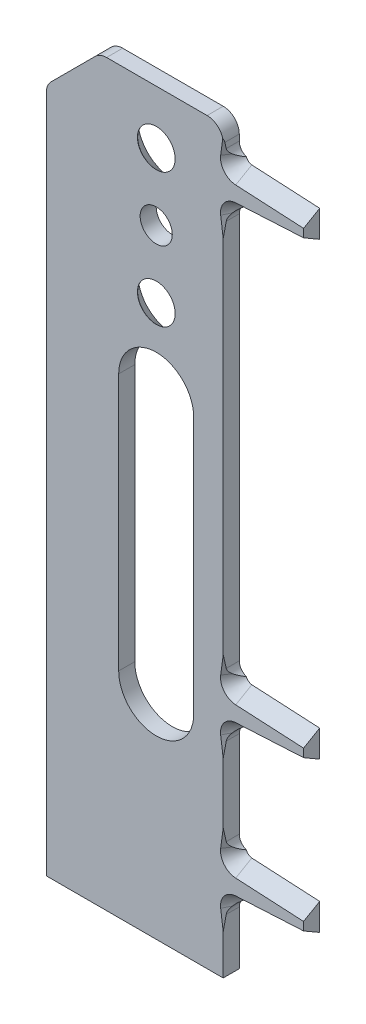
from build123d import *

# Parameters (mm, degrees)
ESQUISSE1_R                = 3.5
ESQUISSE1_R_2              = 3
EXTRUSION1_DEPTH           = 3
R_P_TITION_LIN_AIRE2_COUNT = 2
R_P_TITION_LIN_AIRE2_PITCH = 28
R_P_TITION_LIN_AIRE4_COUNT = 2
R_P_TITION_LIN_AIRE4_PITCH = 112
R_P_TITION_LIN_AIRE5_COUNT = 2
R_P_TITION_LIN_AIRE5_PITCH = 25


with BuildPart() as part:
    # Esquisse1 → Extrusion1 (new body)
    with BuildSketch(Plane.XY):
        with BuildLine():
            Line((10.127031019, 50), (-8.630328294, 50))
            ThreePointArc((-8.630328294, 50), (-9.778378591, 49.771638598), (-10.751648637, 49.121320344))
            Line((-10.751648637, 49.121320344), (-18.994289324, 40.878679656))
            ThreePointArc((-18.994289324, 40.878679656), (-19.644607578, 39.90540961), (-19.872968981, 38.757359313))
            Line((-19.872968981, 38.757359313), (-19.872968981, -87.870449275))
            Line((-19.872968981, -87.870449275), (13.127031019, -87.870449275))
            Line((13.127031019, -87.870449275), (13.127031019, -77.877371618))
            ThreePointArc((13.127031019, -77.877371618), (13.640741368, -76.539110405), (14.917974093, -75.888327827))
            Line((14.917974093, -75.888327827), (28.127031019, -74.5))
            Line((28.127031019, -74.5), (28.127031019, -69.5))
            Line((28.127031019, -69.5), (14.917974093, -68.111672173))
            ThreePointArc((14.917974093, -68.111672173), (13.640741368, -67.460889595), (13.127031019, -66.122628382))
            Line((13.127031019, -66.122628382), (13.127031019, -49.877371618))
            ThreePointArc((13.127031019, -49.877371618), (13.640741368, -48.539110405), (14.917974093, -47.888327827))
            Line((14.917974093, -47.888327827), (28.127031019, -46.5))
            Line((28.127031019, -46.5), (28.127031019, -41.5))
            Line((28.127031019, -41.5), (14.917974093, -40.111672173))
            ThreePointArc((14.917974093, -40.111672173), (13.640741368, -39.460889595), (13.127031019, -38.122628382))
            Line((13.127031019, -38.122628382), (13.127031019, 34.122628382))
            ThreePointArc((13.127031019, 34.122628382), (13.640741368, 35.460889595), (14.917974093, 36.111672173))
            Line((14.917974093, 36.111672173), (28.127031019, 37.5))
            Line((28.127031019, 37.5), (28.127031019, 42.5))
            Line((28.127031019, 42.5), (14.917974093, 43.888327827))
            ThreePointArc((14.917974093, 43.888327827), (13.640741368, 44.539110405), (13.127031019, 45.877371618))
            Line((13.127031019, 45.877371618), (13.127031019, 47))
            ThreePointArc((13.127031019, 47), (12.248351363, 49.121320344), (10.127031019, 50))
        make_face()
        with Locations((0.627031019, 40)):
            Circle(ESQUISSE1_R, mode=Mode.SUBTRACT)
        with Locations((0.627031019, 27.5)):
            Circle(ESQUISSE1_R_2, mode=Mode.SUBTRACT)
        with Locations((0.627031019, 15)):
            Circle(ESQUISSE1_R, mode=Mode.SUBTRACT)
        with BuildLine():
            Line((7.627031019, 0), (7.627031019, -48))
            ThreePointArc((7.627031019, -48), (0.627031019, -55), (-6.372968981, -48))
            Line((-6.372968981, -48), (-6.372968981, 0))
            ThreePointArc((-6.372968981, 0), (0.627031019, 7), (7.627031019, 0))
        make_face(mode=Mode.SUBTRACT)
    extrude(amount=EXTRUSION1_DEPTH)

    # Enl_vement de mati_re-Balayage8: sweep along a path in Esquisse5
    with BuildLine(Plane(origin=(0, 0, 3), x_dir=(-1, 0, 0), z_dir=(0, 0, -1))) as enl_vement_de_mati_re_balayage8_path:
        Line((-28.127031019, -71.232050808), (-15.466947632, -70.558160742))
        ThreePointArc((-15.466947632, -70.558160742), (-13.316953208, -69.477188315), (-12.6529604, -67.16416195))
        Line((-12.6529604, -67.16416195), (-13.127031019, -63.624523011))
    # Esquisse4 → Enl_vement de mati_re-Balayage8 (sweep, cut)
    with BuildSketch(Plane(origin=(28.127031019, 0, 0), x_dir=(0, 0, -1), z_dir=(1, 0, 0))):
        Polygon((-3, -68.815323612), (1.179, -68.802107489), (-3, -71.232050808), align=None)
    enl_vement_de_mati_re_balayage8 = sweep(path=enl_vement_de_mati_re_balayage8_path.line, mode=Mode.SUBTRACT)

    # Sym_trie6: Enl_vement de mati_re-Balayage8 across plane
    add(enl_vement_de_mati_re_balayage8.mirror(Plane(origin=(0, -72.000449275, 0), x_dir=(0, 0, 1), z_dir=(0, -1, 0))), mode=Mode.SUBTRACT)

    # R_p_tition lin_aire2: Enl_vement de mati_re-Balayage8 ×2
    with Locations(*[(0, i * R_P_TITION_LIN_AIRE2_PITCH, 0) for i in range(1, R_P_TITION_LIN_AIRE2_COUNT)]):
        add(enl_vement_de_mati_re_balayage8, mode=Mode.SUBTRACT)

    # R_p_tition lin_aire2 copy 1: sweep along a path in R_p_tition lin_aire2 copy 1 path
    with BuildLine(Plane(origin=(0, -116.000898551, 3), x_dir=(-1, 0, 0), z_dir=(0, 0, -1))) as r_p_tition_lin_aire2_copy_1_path:
        Line((-28.127031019, 71.232050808), (-15.466947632, 70.558160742))
        ThreePointArc((-15.466947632, 70.558160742), (-13.316953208, 69.477188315), (-12.6529604, 67.16416195))
        Line((-12.6529604, 67.16416195), (-13.127031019, 63.624523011))
    # R_p_tition lin_aire2 copy 1 sketch → R_p_tition lin_aire2 copy 1 (sweep, cut)
    with BuildSketch(Plane(origin=(28.127031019, -116.000898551, 0), x_dir=(0, 0, -1), z_dir=(1, 0, 0))):
        Polygon((-3, 68.815323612), (1.179, 68.802107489), (-3, 71.232050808), align=None)
    sweep(path=r_p_tition_lin_aire2_copy_1_path.line, mode=Mode.SUBTRACT)

    # R_p_tition lin_aire4: Enl_vement de mati_re-Balayage8 ×2
    with Locations(*[(0, i * R_P_TITION_LIN_AIRE4_PITCH, 0) for i in range(1, R_P_TITION_LIN_AIRE4_COUNT)]):
        add(enl_vement_de_mati_re_balayage8, mode=Mode.SUBTRACT)

    # R_p_tition lin_aire4 copy 1: sweep along a path in R_p_tition lin_aire4 copy 1 path
    with BuildLine(Plane(origin=(0, -32.000898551, 3), x_dir=(-1, 0, 0), z_dir=(0, 0, -1))) as r_p_tition_lin_aire4_copy_1_path:
        Line((-28.127031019, 71.232050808), (-15.466947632, 70.558160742))
        ThreePointArc((-15.466947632, 70.558160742), (-13.316953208, 69.477188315), (-12.6529604, 67.16416195))
        Line((-12.6529604, 67.16416195), (-13.127031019, 63.624523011))
    # R_p_tition lin_aire4 copy 1 sketch → R_p_tition lin_aire4 copy 1 (sweep, cut)
    with BuildSketch(Plane(origin=(28.127031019, -32.000898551, 0), x_dir=(0, 0, -1), z_dir=(1, 0, 0))):
        Polygon((-3, 68.815323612), (1.179, 68.802107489), (-3, 71.232050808), align=None)
    sweep(path=r_p_tition_lin_aire4_copy_1_path.line, mode=Mode.SUBTRACT)

    # Esquisse6 → Enl_vement de mati_re-R_volution1 (revolve, cut)
    with BuildSketch(Plane.ZY.offset(-0.667031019), mode=Mode.PRIVATE) as enl_vement_de_mati_re_r_volution1_sk:
        Polygon((0, 46.5), (3, 43.5), (3, 40), (0, 40), align=None)
    enl_vement_de_mati_re_r_volution1 = revolve(enl_vement_de_mati_re_r_volution1_sk.sketch.rotate(Axis((0.667031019, 40, 0), (0, 0, 1)), 90), axis=Axis((0.667031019, 40, 0), (0, 0, 1)), mode=Mode.SUBTRACT)

    # R_p_tition lin_aire5: Enl_vement de mati_re-R_volution1 ×2
    with Locations(*[(0, -i * R_P_TITION_LIN_AIRE5_PITCH, 0) for i in range(1, R_P_TITION_LIN_AIRE5_COUNT)]):
        add(enl_vement_de_mati_re_r_volution1, mode=Mode.SUBTRACT)


solid = part.part
